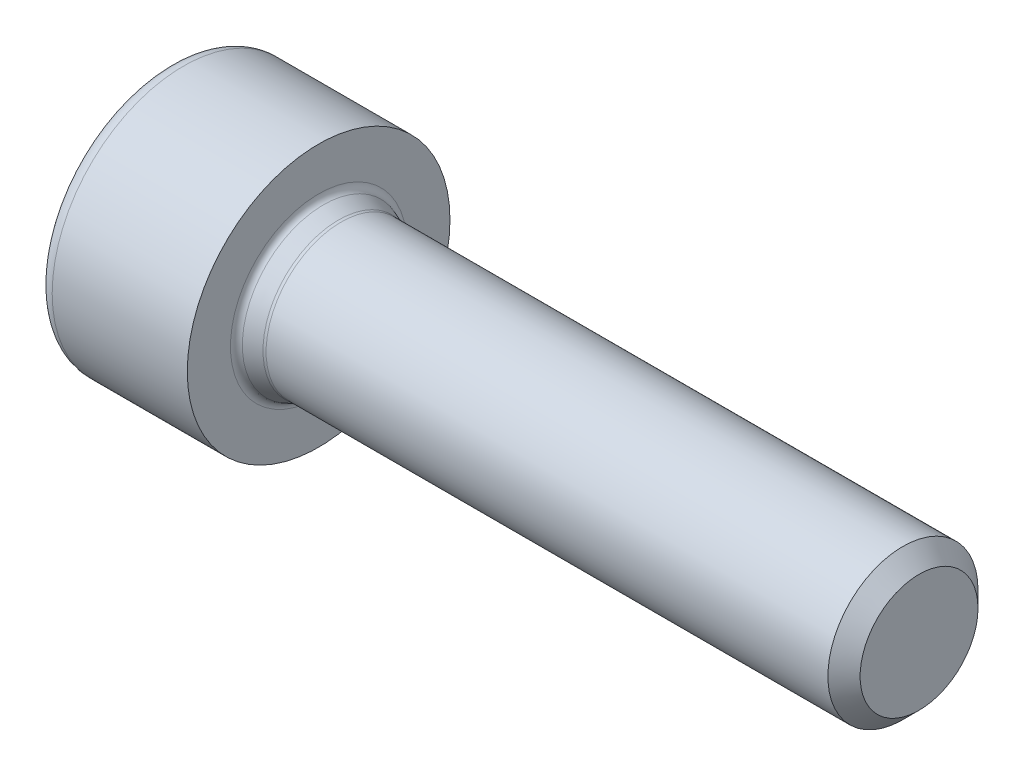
ISO-10303-21;
HEADER;
FILE_DESCRIPTION(('STEP AP214'),'2;1');
FILE_NAME('part.step','',(''),(''),'','','');
FILE_SCHEMA(('AUTOMOTIVE_DESIGN { 1 0 10303 214 1 1 1 1 }'));
ENDSEC;
DATA;
#1=APPLICATION_CONTEXT('core data for automotive mechanical design processes');
#2=APPLICATION_PROTOCOL_DEFINITION('international standard','automotive_design',2000,#1);
#3=PRODUCT_CONTEXT('',#1,'mechanical');
#4=PRODUCT('Part','Part','',(#3));
#5=PRODUCT_RELATED_PRODUCT_CATEGORY('part','',(#4));
#6=PRODUCT_DEFINITION_FORMATION('','',#4);
#7=PRODUCT_DEFINITION_CONTEXT('part definition',#1,'design');
#8=PRODUCT_DEFINITION('design','',#6,#7);
#9=PRODUCT_DEFINITION_SHAPE('','',#8);
#10=(LENGTH_UNIT() NAMED_UNIT(*) SI_UNIT(.MILLI.,.METRE.));
#11=(NAMED_UNIT(*) PLANE_ANGLE_UNIT() SI_UNIT($,.RADIAN.));
#12=(NAMED_UNIT(*) SI_UNIT($,.STERADIAN.) SOLID_ANGLE_UNIT());
#13=UNCERTAINTY_MEASURE_WITH_UNIT(LENGTH_MEASURE(1.E-05),#10,'distance_accuracy_value','');
#14=(GEOMETRIC_REPRESENTATION_CONTEXT(3) GLOBAL_UNCERTAINTY_ASSIGNED_CONTEXT((#13)) GLOBAL_UNIT_ASSIGNED_CONTEXT((#10,
#11,#12)) REPRESENTATION_CONTEXT('',''));
#15=CARTESIAN_POINT('',(0.,0.,0.));
#16=DIRECTION('',(0.,0.,1.));
#17=DIRECTION('',(1.,0.,0.));
#18=AXIS2_PLACEMENT_3D('',#15,#16,#17);
#19=CARTESIAN_POINT('',(-3.78,0.,0.));
#20=DIRECTION('',(-1.,0.,0.));
#21=DIRECTION('',(0.,0.,1.));
#22=AXIS2_PLACEMENT_3D('',#19,#20,#21);
#23=CONICAL_SURFACE('',#22,1.5,0.785398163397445);
#24=CARTESIAN_POINT('',(-4.,0.,0.));
#25=DIRECTION('',(1.,0.,0.));
#26=DIRECTION('',(0.,0.489340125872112,0.872093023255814));
#27=AXIS2_PLACEMENT_3D('',#24,#25,#26);
#28=CIRCLE('',#27,1.72);
#29=CARTESIAN_POINT('',(-4.,0.841665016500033,1.5));
#30=VERTEX_POINT('',#29);
#31=CARTESIAN_POINT('',(-4.,-0.841665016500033,1.5));
#32=VERTEX_POINT('',#31);
#33=EDGE_CURVE('E7',#30,#32,#28,.T.);
#34=ORIENTED_EDGE('',*,*,#33,.F.);
#35=CARTESIAN_POINT('',(-3.99999989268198,0.841664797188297,1.5));
#36=CARTESIAN_POINT('',(-3.99167964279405,0.82466730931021,1.49999556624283));
#37=CARTESIAN_POINT('',(-3.98348579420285,0.807606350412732,1.49995463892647));
#38=CARTESIAN_POINT('',(-3.96770395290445,0.773934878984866,1.49986126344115));
#39=CARTESIAN_POINT('',(-3.96010478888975,0.75732959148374,1.49980927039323));
#40=CARTESIAN_POINT('',(-3.94540605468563,0.724258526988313,1.49974728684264));
#41=CARTESIAN_POINT('',(-3.93829992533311,0.707795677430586,1.49973655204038));
#42=CARTESIAN_POINT('',(-3.92447469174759,0.674711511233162,1.4997624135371));
#43=CARTESIAN_POINT('',(-3.91775551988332,0.658090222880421,1.49979900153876));
#44=CARTESIAN_POINT('',(-3.90459524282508,0.624399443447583,1.49989311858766));
#45=CARTESIAN_POINT('',(-3.89816114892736,0.607327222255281,1.499951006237));
#46=CARTESIAN_POINT('',(-3.88549270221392,0.572588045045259,1.5000063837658));
#47=CARTESIAN_POINT('',(-3.87926834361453,0.554917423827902,1.50000221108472));
#48=CARTESIAN_POINT('',(-3.86734091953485,0.519360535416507,1.5000653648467));
#49=CARTESIAN_POINT('',(-3.8616389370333,0.501473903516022,1.50013283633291));
#50=CARTESIAN_POINT('',(-3.85077525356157,0.465594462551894,1.50028280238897));
#51=CARTESIAN_POINT('',(-3.84561203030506,0.447602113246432,1.50036525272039));
#52=CARTESIAN_POINT('',(-3.83584429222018,0.411547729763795,1.50052646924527));
#53=CARTESIAN_POINT('',(-3.83123750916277,0.39348631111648,1.50060524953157));
#54=CARTESIAN_POINT('',(-3.82259463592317,0.357330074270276,1.50073979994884));
#55=CARTESIAN_POINT('',(-3.81855560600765,0.33923595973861,1.50079569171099));
#56=CARTESIAN_POINT('',(-3.81106188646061,0.303047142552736,1.5008745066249));
#57=CARTESIAN_POINT('',(-3.80760363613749,0.284953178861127,1.50089763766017));
#58=CARTESIAN_POINT('',(-3.80128460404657,0.248794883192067,1.50090724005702));
#59=CARTESIAN_POINT('',(-3.79841971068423,0.230731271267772,1.500893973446));
#60=CARTESIAN_POINT('',(-3.7933006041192,0.194661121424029,1.50083376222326));
#61=CARTESIAN_POINT('',(-3.79104180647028,0.176655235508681,1.50078708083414));
#62=CARTESIAN_POINT('',(-3.7871478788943,0.140725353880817,1.50066899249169));
#63=CARTESIAN_POINT('',(-3.78550778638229,0.122801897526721,1.50059779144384));
#64=CARTESIAN_POINT('',(-3.78286457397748,0.0870591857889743,1.50044579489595));
#65=CARTESIAN_POINT('',(-3.78185622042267,0.0692403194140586,1.5003650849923));
#66=CARTESIAN_POINT('',(-3.78048817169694,0.033726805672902,1.50021313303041));
#67=CARTESIAN_POINT('',(-3.78012311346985,0.0160323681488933,1.5001418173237));
#68=CARTESIAN_POINT('',(-3.78005873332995,-0.0192143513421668,1.50003834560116));
#69=CARTESIAN_POINT('',(-3.78035402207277,-0.0367666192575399,1.50000587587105));
#70=CARTESIAN_POINT('',(-3.78161051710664,-0.0718142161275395,1.49999434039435));
#71=CARTESIAN_POINT('',(-3.78257047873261,-0.0893095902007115,1.50001517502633));
#72=CARTESIAN_POINT('',(-3.78511769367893,-0.124357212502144,1.50007393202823));
#73=CARTESIAN_POINT('',(-3.78670859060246,-0.141909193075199,1.50011195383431));
#74=CARTESIAN_POINT('',(-3.79050871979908,-0.177071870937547,1.50019659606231));
#75=CARTESIAN_POINT('',(-3.79272225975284,-0.194682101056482,1.50024327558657));
#76=CARTESIAN_POINT('',(-3.79775220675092,-0.22996061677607,1.50033234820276));
#77=CARTESIAN_POINT('',(-3.80057332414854,-0.247628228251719,1.5003747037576));
#78=CARTESIAN_POINT('',(-3.80680498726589,-0.283018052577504,1.50044670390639));
#79=CARTESIAN_POINT('',(-3.81022046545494,-0.300739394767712,1.50047623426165));
#80=CARTESIAN_POINT('',(-3.81762711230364,-0.336230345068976,1.50051665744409));
#81=CARTESIAN_POINT('',(-3.82162326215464,-0.353998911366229,1.50052737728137));
#82=CARTESIAN_POINT('',(-3.83017778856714,-0.389574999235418,1.50052770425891));
#83=CARTESIAN_POINT('',(-3.83474105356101,-0.407381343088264,1.50051711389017));
#84=CARTESIAN_POINT('',(-3.84441652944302,-0.443020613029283,1.5004761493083));
#85=CARTESIAN_POINT('',(-3.84953342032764,-0.460852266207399,1.50044559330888));
#86=CARTESIAN_POINT('',(-3.86030267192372,-0.496526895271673,1.50036972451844));
#87=CARTESIAN_POINT('',(-3.86595940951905,-0.514368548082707,1.50032428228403));
#88=CARTESIAN_POINT('',(-3.87779615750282,-0.550044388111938,1.50022977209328));
#89=CARTESIAN_POINT('',(-3.88398018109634,-0.567877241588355,1.50018067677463));
#90=CARTESIAN_POINT('',(-3.89685486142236,-0.603515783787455,1.50008877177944));
#91=CARTESIAN_POINT('',(-3.90354907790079,-0.621320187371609,1.50004601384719));
#92=CARTESIAN_POINT('',(-3.91741278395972,-0.656790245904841,1.50000498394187));
#93=CARTESIAN_POINT('',(-3.92458334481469,-0.674455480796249,1.50000681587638));
#94=CARTESIAN_POINT('',(-3.93899822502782,-0.708948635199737,1.49996730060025));
#95=CARTESIAN_POINT('',(-3.94622874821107,-0.725782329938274,1.49992763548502));
#96=CARTESIAN_POINT('',(-3.9609395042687,-0.75899239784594,1.49990225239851));
#97=CARTESIAN_POINT('',(-3.96841325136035,-0.775371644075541,1.49991561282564));
#98=CARTESIAN_POINT('',(-3.9838737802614,-0.808413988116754,1.49995679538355));
#99=CARTESIAN_POINT('',(-3.99186889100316,-0.825073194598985,1.49998498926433));
#100=CARTESIAN_POINT('',(-3.99999962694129,-0.841664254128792,1.5));
#101=B_SPLINE_CURVE_WITH_KNOTS('',3,(#35,#36,#37,#38,#39,#40,#41,#42,#43,#44,#45,#46,#47,#48,
#49,#50,#51,#52,#53,#54,#55,#56,#57,#58,#59,#60,#61,#62,#63,#64,#65,#66,#67,#68,#69,#70,#71,#72,
#73,#74,#75,#76,#77,#78,#79,#80,#81,#82,#83,#84,#85,#86,#87,#88,#89,#90,#91,#92,#93,#94,#95,#96,
#97,#98,#99,#100),.UNSPECIFIED.,.F.,.F.,(4,2,2,2,2,2,2,2,2,2,2,2,2,2,2,2,2,2,2,2,2,2,2,2,2,2,2,
2,2,2,2,2,4),(0.,0.0567755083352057,0.111556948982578,0.165345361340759,0.219124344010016,
0.273853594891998,0.330051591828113,0.386363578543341,0.442511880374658,0.498422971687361,
0.55403296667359,0.609288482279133,0.664147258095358,0.718578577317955,0.772563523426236,
0.826095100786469,0.879178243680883,0.931829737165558,0.984382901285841,1.03724408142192,
1.09048037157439,1.14414528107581,1.19827886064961,1.25290771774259,1.30804522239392,
1.36369188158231,1.41983586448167,1.47645366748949,1.5335109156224,1.59070113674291,
1.64565974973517,1.69966738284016,1.75509796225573),.UNSPECIFIED.);
#102=EDGE_CURVE('E11',#30,#32,#101,.T.);
#103=ORIENTED_EDGE('',*,*,#102,.T.);
#104=EDGE_LOOP('',(#34,#103));
#105=FACE_BOUND('',#104,.T.);
#106=ADVANCED_FACE('F27',(#105),#23,.F.);
#107=CARTESIAN_POINT('',(-4.,0.,-1.72));
#108=DIRECTION('',(1.,0.,0.));
#109=DIRECTION('',(0.,0.,-1.));
#110=AXIS2_PLACEMENT_3D('',#107,#108,#109);
#111=PLANE('',#110);
#112=CARTESIAN_POINT('',(-4.,0.,0.));
#113=DIRECTION('',(1.,0.,0.));
#114=DIRECTION('',(0.,0.,-1.));
#115=AXIS2_PLACEMENT_3D('',#112,#113,#114);
#116=CIRCLE('',#115,3.10000002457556);
#117=CARTESIAN_POINT('',(-4.,0.,-3.10000002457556));
#118=VERTEX_POINT('',#117);
#119=EDGE_CURVE('E38',#118,#118,#116,.T.);
#120=ORIENTED_EDGE('',*,*,#119,.F.);
#121=EDGE_LOOP('',(#120));
#122=FACE_BOUND('',#121,.T.);
#123=ORIENTED_EDGE('',*,*,#33,.T.);
#124=DIRECTION('',(0.,-1.,0.));
#125=VECTOR('',#124,1.);
#126=CARTESIAN_POINT('',(-4.,-0.841665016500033,1.5));
#127=LINE('',#126,#125);
#128=CARTESIAN_POINT('',(-4.,-0.86602540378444,1.5));
#129=VERTEX_POINT('',#128);
#130=EDGE_CURVE('E45',#32,#129,#127,.T.);
#131=ORIENTED_EDGE('',*,*,#130,.T.);
#132=DIRECTION('',(0.,-0.500000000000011,-0.866025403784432));
#133=VECTOR('',#132,1.);
#134=CARTESIAN_POINT('',(-4.,-0.866025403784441,1.5));
#135=LINE('',#134,#133);
#136=CARTESIAN_POINT('',(-4.,-0.878205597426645,1.47890328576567));
#137=VERTEX_POINT('',#136);
#138=EDGE_CURVE('E52',#129,#137,#135,.T.);
#139=ORIENTED_EDGE('',*,*,#138,.T.);
#140=CARTESIAN_POINT('',(-4.,0.,0.));
#141=DIRECTION('',(1.,0.,0.));
#142=DIRECTION('',(0.,-0.510584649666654,0.85982749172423));
#143=AXIS2_PLACEMENT_3D('',#140,#141,#142);
#144=CIRCLE('',#143,1.72);
#145=CARTESIAN_POINT('',(-4.,-1.71987061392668,0.0210967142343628));
#146=VERTEX_POINT('',#145);
#147=EDGE_CURVE('E59',#137,#146,#144,.T.);
#148=ORIENTED_EDGE('',*,*,#147,.T.);
#149=DIRECTION('',(0.,-0.500000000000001,-0.866025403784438));
#150=VECTOR('',#149,1.);
#151=CARTESIAN_POINT('',(-4.,-1.71987061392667,0.0210967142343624));
#152=LINE('',#151,#150);
#153=CARTESIAN_POINT('',(-4.,-1.7320508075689,0.));
#154=VERTEX_POINT('',#153);
#155=EDGE_CURVE('E66',#146,#154,#152,.T.);
#156=ORIENTED_EDGE('',*,*,#155,.T.);
#157=DIRECTION('',(0.,0.500000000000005,-0.866025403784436));
#158=VECTOR('',#157,1.);
#159=CARTESIAN_POINT('',(-4.,-1.7320508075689,0.));
#160=LINE('',#159,#158);
#161=CARTESIAN_POINT('',(-4.,-1.71987061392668,-0.0210967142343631));
#162=VERTEX_POINT('',#161);
#163=EDGE_CURVE('E73',#154,#162,#160,.T.);
#164=ORIENTED_EDGE('',*,*,#163,.T.);
#165=CARTESIAN_POINT('',(-4.,0.,0.));
#166=DIRECTION('',(1.,0.,0.));
#167=DIRECTION('',(0.,-0.999924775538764,-0.0122655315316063));
#168=AXIS2_PLACEMENT_3D('',#165,#166,#167);
#169=CIRCLE('',#168,1.72);
#170=CARTESIAN_POINT('',(-4.,-0.878205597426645,-1.47890328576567));
#171=VERTEX_POINT('',#170);
#172=EDGE_CURVE('E80',#162,#171,#169,.T.);
#173=ORIENTED_EDGE('',*,*,#172,.T.);
#174=DIRECTION('',(0.,0.500000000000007,-0.866025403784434));
#175=VECTOR('',#174,1.);
#176=CARTESIAN_POINT('',(-4.,-0.878205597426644,-1.47890328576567));
#177=LINE('',#176,#175);
#178=CARTESIAN_POINT('',(-4.,-0.86602540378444,-1.5));
#179=VERTEX_POINT('',#178);
#180=EDGE_CURVE('E87',#171,#179,#177,.T.);
#181=ORIENTED_EDGE('',*,*,#180,.T.);
#182=DIRECTION('',(0.,1.,0.));
#183=VECTOR('',#182,1.);
#184=CARTESIAN_POINT('',(-4.,-0.86602540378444,-1.5));
#185=LINE('',#184,#183);
#186=CARTESIAN_POINT('',(-4.,-0.841665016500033,-1.5));
#187=VERTEX_POINT('',#186);
#188=EDGE_CURVE('E94',#179,#187,#185,.T.);
#189=ORIENTED_EDGE('',*,*,#188,.T.);
#190=CARTESIAN_POINT('',(-4.,0.,0.));
#191=DIRECTION('',(1.,0.,0.));
#192=DIRECTION('',(0.,-0.489340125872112,-0.872093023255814));
#193=AXIS2_PLACEMENT_3D('',#190,#191,#192);
#194=CIRCLE('',#193,1.72);
#195=CARTESIAN_POINT('',(-4.,0.841665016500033,-1.5));
#196=VERTEX_POINT('',#195);
#197=EDGE_CURVE('E101',#187,#196,#194,.T.);
#198=ORIENTED_EDGE('',*,*,#197,.T.);
#199=DIRECTION('',(0.,1.,0.));
#200=VECTOR('',#199,1.);
#201=CARTESIAN_POINT('',(-4.,0.841665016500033,-1.5));
#202=LINE('',#201,#200);
#203=CARTESIAN_POINT('',(-4.,0.86602540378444,-1.5));
#204=VERTEX_POINT('',#203);
#205=EDGE_CURVE('E108',#196,#204,#202,.T.);
#206=ORIENTED_EDGE('',*,*,#205,.T.);
#207=DIRECTION('',(0.,0.500000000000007,0.866025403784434));
#208=VECTOR('',#207,1.);
#209=CARTESIAN_POINT('',(-4.,0.866025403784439,-1.5));
#210=LINE('',#209,#208);
#211=CARTESIAN_POINT('',(-4.,0.878205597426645,-1.47890328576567));
#212=VERTEX_POINT('',#211);
#213=EDGE_CURVE('E115',#204,#212,#210,.T.);
#214=ORIENTED_EDGE('',*,*,#213,.T.);
#215=CARTESIAN_POINT('',(-4.,0.,0.));
#216=DIRECTION('',(1.,0.,0.));
#217=DIRECTION('',(0.,0.510584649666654,-0.859827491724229));
#218=AXIS2_PLACEMENT_3D('',#215,#216,#217);
#219=CIRCLE('',#218,1.72);
#220=CARTESIAN_POINT('',(-4.,1.71987061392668,-0.0210967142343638));
#221=VERTEX_POINT('',#220);
#222=EDGE_CURVE('E122',#212,#221,#219,.T.);
#223=ORIENTED_EDGE('',*,*,#222,.T.);
#224=DIRECTION('',(0.,0.500000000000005,0.866025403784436));
#225=VECTOR('',#224,1.);
#226=CARTESIAN_POINT('',(-4.,1.71987061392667,-0.021096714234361));
#227=LINE('',#226,#225);
#228=CARTESIAN_POINT('',(-4.,1.7320508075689,0.));
#229=VERTEX_POINT('',#228);
#230=EDGE_CURVE('E129',#221,#229,#227,.T.);
#231=ORIENTED_EDGE('',*,*,#230,.T.);
#232=DIRECTION('',(0.,-0.500000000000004,0.866025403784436));
#233=VECTOR('',#232,1.);
#234=CARTESIAN_POINT('',(-4.,1.7320508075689,0.));
#235=LINE('',#234,#233);
#236=CARTESIAN_POINT('',(-4.,1.71987061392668,0.0210967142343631));
#237=VERTEX_POINT('',#236);
#238=EDGE_CURVE('E136',#229,#237,#235,.T.);
#239=ORIENTED_EDGE('',*,*,#238,.T.);
#240=CARTESIAN_POINT('',(-4.,0.,0.));
#241=DIRECTION('',(1.,0.,0.));
#242=DIRECTION('',(0.,0.999924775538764,0.0122655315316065));
#243=AXIS2_PLACEMENT_3D('',#240,#241,#242);
#244=CIRCLE('',#243,1.72);
#245=CARTESIAN_POINT('',(-4.,0.878205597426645,1.47890328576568));
#246=VERTEX_POINT('',#245);
#247=EDGE_CURVE('E143',#237,#246,#244,.T.);
#248=ORIENTED_EDGE('',*,*,#247,.T.);
#249=DIRECTION('',(0.,-0.500000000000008,0.866025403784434));
#250=VECTOR('',#249,1.);
#251=CARTESIAN_POINT('',(-4.,0.878205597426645,1.47890328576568));
#252=LINE('',#251,#250);
#253=CARTESIAN_POINT('',(-4.,0.86602540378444,1.5));
#254=VERTEX_POINT('',#253);
#255=EDGE_CURVE('E150',#246,#254,#252,.T.);
#256=ORIENTED_EDGE('',*,*,#255,.T.);
#257=DIRECTION('',(0.,-1.,0.));
#258=VECTOR('',#257,1.);
#259=CARTESIAN_POINT('',(-4.,0.86602540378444,1.5));
#260=LINE('',#259,#258);
#261=EDGE_CURVE('E157',#254,#30,#260,.T.);
#262=ORIENTED_EDGE('',*,*,#261,.T.);
#263=EDGE_LOOP('',(#123,#131,#139,#148,#156,#164,#173,#181,#189,#198,#206,#214,#223,#231,#239,
#248,#256,#262));
#264=FACE_BOUND('',#263,.T.);
#265=ADVANCED_FACE('F161',(#122,#264),#111,.F.);
#266=CARTESIAN_POINT('',(-5.4,0.86602540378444,1.5));
#267=DIRECTION('',(0.,0.,1.));
#268=DIRECTION('',(1.,0.,0.));
#269=AXIS2_PLACEMENT_3D('',#266,#267,#268);
#270=PLANE('',#269);
#271=DIRECTION('',(0.,-1.,0.));
#272=VECTOR('',#271,1.);
#273=CARTESIAN_POINT('',(-1.4,0.,1.5));
#274=LINE('',#273,#272);
#275=CARTESIAN_POINT('',(-1.4,0.,1.5));
#276=VERTEX_POINT('',#275);
#277=CARTESIAN_POINT('',(-1.4,-0.86602540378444,1.5));
#278=VERTEX_POINT('',#277);
#279=EDGE_CURVE('E170',#276,#278,#274,.T.);
#280=ORIENTED_EDGE('',*,*,#279,.T.);
#281=DIRECTION('',(1.,0.,0.));
#282=VECTOR('',#281,1.);
#283=CARTESIAN_POINT('',(-4.,-0.86602540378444,1.5));
#284=LINE('',#283,#282);
#285=EDGE_CURVE('E177',#129,#278,#284,.T.);
#286=ORIENTED_EDGE('',*,*,#285,.F.);
#287=ORIENTED_EDGE('',*,*,#130,.F.);
#288=ORIENTED_EDGE('',*,*,#102,.F.);
#289=ORIENTED_EDGE('',*,*,#261,.F.);
#290=DIRECTION('',(1.,0.,0.));
#291=VECTOR('',#290,1.);
#292=CARTESIAN_POINT('',(-4.,0.86602540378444,1.5));
#293=LINE('',#292,#291);
#294=CARTESIAN_POINT('',(-1.4,0.86602540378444,1.5));
#295=VERTEX_POINT('',#294);
#296=EDGE_CURVE('E196',#254,#295,#293,.T.);
#297=ORIENTED_EDGE('',*,*,#296,.T.);
#298=DIRECTION('',(0.,-1.,0.));
#299=VECTOR('',#298,1.);
#300=CARTESIAN_POINT('',(-1.4,0.86602540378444,1.5));
#301=LINE('',#300,#299);
#302=EDGE_CURVE('E203',#295,#276,#301,.T.);
#303=ORIENTED_EDGE('',*,*,#302,.T.);
#304=EDGE_LOOP('',(#280,#286,#287,#288,#289,#297,#303));
#305=FACE_BOUND('',#304,.T.);
#306=ADVANCED_FACE('F208',(#305),#270,.F.);
#307=CARTESIAN_POINT('',(-3.59999999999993,0.,0.));
#308=DIRECTION('',(1.,0.,0.));
#309=DIRECTION('',(0.,0.,-1.));
#310=AXIS2_PLACEMENT_3D('',#307,#308,#309);
#311=TOROIDAL_SURFACE('',#310,3.09999999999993,0.400000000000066);
#312=ORIENTED_EDGE('',*,*,#119,.T.);
#313=EDGE_LOOP('',(#312));
#314=FACE_BOUND('',#313,.T.);
#315=CARTESIAN_POINT('',(-3.6,0.,0.));
#316=DIRECTION('',(1.,0.,0.));
#317=DIRECTION('',(0.,0.,-1.));
#318=AXIS2_PLACEMENT_3D('',#315,#316,#317);
#319=CIRCLE('',#318,3.5);
#320=CARTESIAN_POINT('',(-3.6,0.,-3.5));
#321=VERTEX_POINT('',#320);
#322=EDGE_CURVE('E217',#321,#321,#319,.T.);
#323=ORIENTED_EDGE('',*,*,#322,.F.);
#324=EDGE_LOOP('',(#323));
#325=FACE_BOUND('',#324,.T.);
#326=ADVANCED_FACE('F221',(#314,#325),#311,.T.);
#327=CARTESIAN_POINT('',(-5.4,-0.86602540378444,1.5));
#328=DIRECTION('',(0.,-0.866025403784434,0.500000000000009));
#329=DIRECTION('',(0.,-0.500000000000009,-0.866025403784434));
#330=AXIS2_PLACEMENT_3D('',#327,#328,#329);
#331=PLANE('',#330);
#332=DIRECTION('',(0.,-0.500000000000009,-0.866025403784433));
#333=VECTOR('',#332,1.);
#334=CARTESIAN_POINT('',(-1.4,-1.29903810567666,0.750000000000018));
#335=LINE('',#334,#333);
#336=CARTESIAN_POINT('',(-1.4,-1.29903810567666,0.750000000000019));
#337=VERTEX_POINT('',#336);
#338=CARTESIAN_POINT('',(-1.4,-1.7320508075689,0.));
#339=VERTEX_POINT('',#338);
#340=EDGE_CURVE('E230',#337,#339,#335,.T.);
#341=ORIENTED_EDGE('',*,*,#340,.T.);
#342=DIRECTION('',(1.,0.,0.));
#343=VECTOR('',#342,1.);
#344=CARTESIAN_POINT('',(-4.,-1.7320508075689,0.));
#345=LINE('',#344,#343);
#346=EDGE_CURVE('E237',#154,#339,#345,.T.);
#347=ORIENTED_EDGE('',*,*,#346,.F.);
#348=ORIENTED_EDGE('',*,*,#155,.F.);
#349=CARTESIAN_POINT('',(-3.9999999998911,-0.878205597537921,1.47890328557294));
#350=CARTESIAN_POINT('',(-3.9878022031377,-0.890672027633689,1.45731124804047));
#351=CARTESIAN_POINT('',(-3.97588207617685,-0.903147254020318,1.43556306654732));
#352=CARTESIAN_POINT('',(-3.95321065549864,-0.927659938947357,1.39267517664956));
#353=CARTESIAN_POINT('',(-3.94243130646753,-0.939693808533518,1.37154821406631));
#354=CARTESIAN_POINT('',(-3.92201194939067,-0.963438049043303,1.32982831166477));
#355=CARTESIAN_POINT('',(-3.9123440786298,-0.9751430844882,1.30924604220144));
#356=CARTESIAN_POINT('',(-3.89412158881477,-0.998330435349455,1.26853248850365));
#357=CARTESIAN_POINT('',(-3.8855402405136,-1.00980672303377,1.24840977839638));
#358=CARTESIAN_POINT('',(-3.86946239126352,-1.03262384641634,1.20852318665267));
#359=CARTESIAN_POINT('',(-3.86194163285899,-1.04395894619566,1.18876584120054));
#360=CARTESIAN_POINT('',(-3.84795558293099,-1.06656741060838,1.14950942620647));
#361=CARTESIAN_POINT('',(-3.84146987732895,-1.07783612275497,1.13001497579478));
#362=CARTESIAN_POINT('',(-3.82952268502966,-1.10037142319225,1.09117541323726));
#363=CARTESIAN_POINT('',(-3.82404594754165,-1.11163492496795,1.07183321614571));
#364=CARTESIAN_POINT('',(-3.81408561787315,-1.13420675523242,1.03318201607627));
#365=CARTESIAN_POINT('',(-3.80959296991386,-1.14551360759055,1.01387448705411));
#366=CARTESIAN_POINT('',(-3.80156357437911,-1.1682003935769,0.975166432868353));
#367=CARTESIAN_POINT('',(-3.79802461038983,-1.17958009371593,0.955766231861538));
#368=CARTESIAN_POINT('',(-3.79188431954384,-1.20244329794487,0.916748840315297));
#369=CARTESIAN_POINT('',(-3.78928772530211,-1.21392703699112,0.897131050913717));
#370=CARTESIAN_POINT('',(-3.78494041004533,-1.23695455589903,0.85750588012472));
#371=CARTESIAN_POINT('',(-3.78320056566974,-1.24849731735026,0.837496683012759));
#372=CARTESIAN_POINT('',(-3.78088731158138,-1.27195485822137,0.797087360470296));
#373=CARTESIAN_POINT('',(-3.78033798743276,-1.2838724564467,0.776687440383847));
#374=CARTESIAN_POINT('',(-3.78037360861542,-1.3079382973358,0.735525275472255));
#375=CARTESIAN_POINT('',(-3.78097950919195,-1.320086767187,0.714763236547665));
#376=CARTESIAN_POINT('',(-3.78330588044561,-1.34448805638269,0.67295857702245));
#377=CARTESIAN_POINT('',(-3.78504237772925,-1.35673983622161,0.651916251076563));
#378=CARTESIAN_POINT('',(-3.78960824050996,-1.38124371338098,0.609655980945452));
#379=CARTESIAN_POINT('',(-3.79244878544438,-1.3934944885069,0.588438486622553));
#380=CARTESIAN_POINT('',(-3.79920187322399,-1.41792015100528,0.545957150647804));
#381=CARTESIAN_POINT('',(-3.80312078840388,-1.43009413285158,0.524693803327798));
#382=CARTESIAN_POINT('',(-3.81200810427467,-1.45431682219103,0.48227491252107));
#383=CARTESIAN_POINT('',(-3.81697797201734,-1.46636532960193,0.461119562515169));
#384=CARTESIAN_POINT('',(-3.82795075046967,-1.49032177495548,0.419100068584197));
#385=CARTESIAN_POINT('',(-3.83394997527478,-1.50223005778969,0.398235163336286));
#386=CARTESIAN_POINT('',(-3.84692210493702,-1.52586543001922,0.357066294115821));
#387=CARTESIAN_POINT('',(-3.85388245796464,-1.53759297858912,0.336758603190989));
#388=CARTESIAN_POINT('',(-3.86840895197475,-1.5606079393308,0.29667512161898));
#389=CARTESIAN_POINT('',(-3.87596102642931,-1.57189948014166,0.276896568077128));
#390=CARTESIAN_POINT('',(-3.89182634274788,-1.59434287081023,0.237699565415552));
#391=CARTESIAN_POINT('',(-3.90013597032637,-1.60549512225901,0.218279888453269));
#392=CARTESIAN_POINT('',(-3.91759449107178,-1.62785983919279,0.179493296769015));
#393=CARTESIAN_POINT('',(-3.92675238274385,-1.63907138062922,0.160129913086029));
#394=CARTESIAN_POINT('',(-3.94600835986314,-1.66172834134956,0.121126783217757));
#395=CARTESIAN_POINT('',(-3.95612596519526,-1.67317115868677,0.101495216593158));
#396=CARTESIAN_POINT('',(-3.97739883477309,-1.69641004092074,0.0615774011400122));
#397=CARTESIAN_POINT('',(-3.98858024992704,-1.70819911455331,0.0413009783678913));
#398=CARTESIAN_POINT('',(-3.99999999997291,-1.71987061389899,0.0210967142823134));
#399=B_SPLINE_CURVE_WITH_KNOTS('',3,(#349,#350,#351,#352,#353,#354,#355,#356,#357,#358,#359,
#360,#361,#362,#363,#364,#365,#366,#367,#368,#369,#370,#371,#372,#373,#374,#375,#376,#377,#378,
#379,#380,#381,#382,#383,#384,#385,#386,#387,#388,#389,#390,#391,#392,#393,#394,#395,#396,#397,
#398),.UNSPECIFIED.,.F.,.F.,(4,2,2,2,2,2,2,2,2,2,2,2,2,2,2,2,2,2,2,2,2,2,2,2,4),(0.,
0.0832721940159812,0.163051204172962,0.239764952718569,0.313861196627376,0.385806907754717,
0.456086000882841,0.525195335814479,0.593639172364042,0.661922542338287,0.730544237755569,
0.800015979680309,0.870880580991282,0.94304287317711,1.01625104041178,1.09022067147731,
1.16463715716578,1.2391582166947,1.31341779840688,1.38678601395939,1.45875653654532,
1.53040005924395,1.60291721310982,1.6775295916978,1.75546795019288),.UNSPECIFIED.);
#400=EDGE_CURVE('E240',#137,#146,#399,.T.);
#401=ORIENTED_EDGE('',*,*,#400,.F.);
#402=ORIENTED_EDGE('',*,*,#138,.F.);
#403=ORIENTED_EDGE('',*,*,#285,.T.);
#404=DIRECTION('',(0.,-0.500000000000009,-0.866025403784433));
#405=VECTOR('',#404,1.);
#406=CARTESIAN_POINT('',(-1.4,-0.86602540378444,1.5));
#407=LINE('',#406,#405);
#408=EDGE_CURVE('E258',#278,#337,#407,.T.);
#409=ORIENTED_EDGE('',*,*,#408,.T.);
#410=EDGE_LOOP('',(#341,#347,#348,#401,#402,#403,#409));
#411=FACE_BOUND('',#410,.T.);
#412=ADVANCED_FACE('F263',(#411),#331,.F.);
#413=ORIENTED_EDGE('',*,*,#147,.F.);
#414=ORIENTED_EDGE('',*,*,#400,.T.);
#415=EDGE_LOOP('',(#413,#414));
#416=FACE_BOUND('',#415,.T.);
#417=ADVANCED_FACE('F282',(#416),#23,.F.);
#418=CARTESIAN_POINT('',(-5.4,-1.7320508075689,0.));
#419=DIRECTION('',(0.,-0.866025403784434,-0.500000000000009));
#420=DIRECTION('',(0.,0.500000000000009,-0.866025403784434));
#421=AXIS2_PLACEMENT_3D('',#418,#419,#420);
#422=PLANE('',#421);
#423=DIRECTION('',(0.,0.500000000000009,-0.866025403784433));
#424=VECTOR('',#423,1.);
#425=CARTESIAN_POINT('',(-1.4,-1.29903810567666,-0.750000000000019));
#426=LINE('',#425,#424);
#427=CARTESIAN_POINT('',(-1.4,-1.29903810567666,-0.750000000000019));
#428=VERTEX_POINT('',#427);
#429=CARTESIAN_POINT('',(-1.4,-0.86602540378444,-1.5));
#430=VERTEX_POINT('',#429);
#431=EDGE_CURVE('E291',#428,#430,#426,.T.);
#432=ORIENTED_EDGE('',*,*,#431,.T.);
#433=DIRECTION('',(1.,0.,0.));
#434=VECTOR('',#433,1.);
#435=CARTESIAN_POINT('',(-4.,-0.86602540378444,-1.5));
#436=LINE('',#435,#434);
#437=EDGE_CURVE('E298',#179,#430,#436,.T.);
#438=ORIENTED_EDGE('',*,*,#437,.F.);
#439=ORIENTED_EDGE('',*,*,#180,.F.);
#440=CARTESIAN_POINT('',(-3.9999999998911,-1.7198706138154,-0.0210967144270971));
#441=CARTESIAN_POINT('',(-3.9878022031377,-1.7074045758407,-0.0426889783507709));
#442=CARTESIAN_POINT('',(-3.97588207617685,-1.69480771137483,-0.0643669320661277));
#443=CARTESIAN_POINT('',(-3.95321065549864,-1.66992205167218,-0.107039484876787));
#444=CARTESIAN_POINT('',(-3.94243130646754,-1.65764250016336,-0.128024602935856));
#445=CARTESIAN_POINT('',(-3.92201194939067,-1.6333841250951,-0.16944766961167));
#446=CARTESIAN_POINT('',(-3.9123440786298,-1.62141187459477,-0.189875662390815));
#447=CARTESIAN_POINT('',(-3.89412158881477,-1.59774657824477,-0.23031327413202));
#448=CARTESIAN_POINT('',(-3.8855402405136,-1.58605794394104,-0.250313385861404));
#449=CARTESIAN_POINT('',(-3.86946239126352,-1.5629237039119,-0.290016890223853));
#450=CARTESIAN_POINT('',(-3.86194163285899,-1.55148089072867,-0.30971204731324));
#451=CARTESIAN_POINT('',(-3.84795558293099,-1.52878807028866,-0.348919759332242));
#452=CARTESIAN_POINT('',(-3.84146987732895,-1.5175397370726,-0.368425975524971));
#453=CARTESIAN_POINT('',(-3.82952268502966,-1.49517133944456,-0.407361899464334));
#454=CARTESIAN_POINT('',(-3.82404594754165,-1.48405225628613,-0.426787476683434));
#455=CARTESIAN_POINT('',(-3.81408561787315,-1.46186525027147,-0.465660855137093));
#456=CARTESIAN_POINT('',(-3.80959296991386,-1.45079786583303,-0.485106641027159));
#457=CARTESIAN_POINT('',(-3.80156357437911,-1.42861910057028,-0.524108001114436));
#458=CARTESIAN_POINT('',(-3.79802461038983,-1.41750788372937,-0.543663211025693));
#459=CARTESIAN_POINT('',(-3.79188431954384,-1.39514943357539,-0.582972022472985));
#460=CARTESIAN_POINT('',(-3.78928772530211,-1.38390179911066,-0.602726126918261));
#461=CARTESIAN_POINT('',(-3.78494041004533,-1.36109915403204,-0.642481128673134));
#462=CARTESIAN_POINT('',(-3.78320056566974,-1.34954206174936,-0.662482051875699));
#463=CARTESIAN_POINT('',(-3.78088731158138,-1.32627533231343,-0.703001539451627));
#464=CARTESIAN_POINT('',(-3.78033798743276,-1.31456728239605,-0.723522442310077));
#465=CARTESIAN_POINT('',(-3.78037360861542,-1.2909527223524,-0.76494515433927));
#466=CARTESIAN_POINT('',(-3.78097950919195,-1.27904650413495,-0.785847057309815));
#467=CARTESIAN_POINT('',(-3.78330588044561,-1.2550432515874,-0.82788152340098));
#468=CARTESIAN_POINT('',(-3.78504237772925,-1.242945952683,-0.849013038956));
#469=CARTESIAN_POINT('',(-3.78960824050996,-1.21859942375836,-0.891364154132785));
#470=CARTESIAN_POINT('',(-3.79244878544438,-1.20634992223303,-0.912582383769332));
#471=CARTESIAN_POINT('',(-3.79920187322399,-1.18177283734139,-0.954976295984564));
#472=CARTESIAN_POINT('',(-3.80312078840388,-1.16944522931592,-0.976150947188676));
#473=CARTESIAN_POINT('',(-3.81200810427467,-1.14482073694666,-1.01833785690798));
#474=CARTESIAN_POINT('',(-3.81697797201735,-1.13252392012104,-1.03934984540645));
#475=CARTESIAN_POINT('',(-3.82795075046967,-1.10811219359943,-1.08110648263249));
#476=CARTESIAN_POINT('',(-3.83394997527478,-1.09599679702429,-1.10185181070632));
#477=CARTESIAN_POINT('',(-3.84692210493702,-1.07216119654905,-1.14290507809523));
#478=CARTESIAN_POINT('',(-3.85388245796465,-1.0604379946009,-1.1632152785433));
#479=CARTESIAN_POINT('',(-3.86840895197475,-1.03723216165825,-1.20318855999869));
#480=CARTESIAN_POINT('',(-3.87596102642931,-1.02574920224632,-1.22285659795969));
#481=CARTESIAN_POINT('',(-3.89182634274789,-1.00302529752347,-1.26189164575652));
#482=CARTESIAN_POINT('',(-3.90013597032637,-0.991783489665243,-1.2812596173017));
#483=CARTESIAN_POINT('',(-3.91759449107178,-0.969375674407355,-1.32002132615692));
#484=CARTESIAN_POINT('',(-3.92675238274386,-0.958212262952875,-1.33941249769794));
#485=CARTESIAN_POINT('',(-3.94600835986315,-0.935763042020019,-1.37853556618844));
#486=CARTESIAN_POINT('',(-3.95612596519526,-0.924483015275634,-1.39826112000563));
#487=CARTESIAN_POINT('',(-3.97739883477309,-0.901532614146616,-1.43834549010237));
#488=CARTESIAN_POINT('',(-3.98858024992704,-0.889867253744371,-1.45869333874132));
#489=CARTESIAN_POINT('',(-3.99999999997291,-0.878205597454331,-1.47890328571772));
#490=B_SPLINE_CURVE_WITH_KNOTS('',3,(#440,#441,#442,#443,#444,#445,#446,#447,#448,#449,#450,
#451,#452,#453,#454,#455,#456,#457,#458,#459,#460,#461,#462,#463,#464,#465,#466,#467,#468,#469,
#470,#471,#472,#473,#474,#475,#476,#477,#478,#479,#480,#481,#482,#483,#484,#485,#486,#487,#488,
#489),.UNSPECIFIED.,.F.,.F.,(4,2,2,2,2,2,2,2,2,2,2,2,2,2,2,2,2,2,2,2,2,2,2,2,4),(0.,
0.083272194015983,0.163051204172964,0.239764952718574,0.31386119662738,0.385806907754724,
0.456086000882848,0.525195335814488,0.593639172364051,0.661922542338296,0.730544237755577,
0.800015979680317,0.870880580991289,0.943042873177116,1.01625104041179,1.09022067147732,
1.16463715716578,1.2391582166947,1.31341779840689,1.3867860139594,1.45875653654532,
1.53040005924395,1.60291721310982,1.6775295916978,1.75546795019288),.UNSPECIFIED.);
#491=EDGE_CURVE('E301',#162,#171,#490,.T.);
#492=ORIENTED_EDGE('',*,*,#491,.F.);
#493=ORIENTED_EDGE('',*,*,#163,.F.);
#494=ORIENTED_EDGE('',*,*,#346,.T.);
#495=DIRECTION('',(0.,0.500000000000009,-0.866025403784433));
#496=VECTOR('',#495,1.);
#497=CARTESIAN_POINT('',(-1.4,-1.7320508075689,0.));
#498=LINE('',#497,#496);
#499=EDGE_CURVE('E319',#339,#428,#498,.T.);
#500=ORIENTED_EDGE('',*,*,#499,.T.);
#501=EDGE_LOOP('',(#432,#438,#439,#492,#493,#494,#500));
#502=FACE_BOUND('',#501,.T.);
#503=ADVANCED_FACE('F324',(#502),#422,.F.);
#504=ORIENTED_EDGE('',*,*,#172,.F.);
#505=ORIENTED_EDGE('',*,*,#491,.T.);
#506=EDGE_LOOP('',(#504,#505));
#507=FACE_BOUND('',#506,.T.);
#508=ADVANCED_FACE('F343',(#507),#23,.F.);
#509=CARTESIAN_POINT('',(-5.4,-0.86602540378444,-1.5));
#510=DIRECTION('',(0.,0.,-1.));
#511=DIRECTION('',(-1.,0.,0.));
#512=AXIS2_PLACEMENT_3D('',#509,#510,#511);
#513=PLANE('',#512);
#514=DIRECTION('',(0.,1.,0.));
#515=VECTOR('',#514,1.);
#516=CARTESIAN_POINT('',(-1.4,0.,-1.5));
#517=LINE('',#516,#515);
#518=CARTESIAN_POINT('',(-1.4,0.,-1.5));
#519=VERTEX_POINT('',#518);
#520=CARTESIAN_POINT('',(-1.4,0.86602540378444,-1.5));
#521=VERTEX_POINT('',#520);
#522=EDGE_CURVE('E352',#519,#521,#517,.T.);
#523=ORIENTED_EDGE('',*,*,#522,.T.);
#524=DIRECTION('',(1.,0.,0.));
#525=VECTOR('',#524,1.);
#526=CARTESIAN_POINT('',(-4.,0.86602540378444,-1.5));
#527=LINE('',#526,#525);
#528=EDGE_CURVE('E359',#204,#521,#527,.T.);
#529=ORIENTED_EDGE('',*,*,#528,.F.);
#530=ORIENTED_EDGE('',*,*,#205,.F.);
#531=CARTESIAN_POINT('',(-3.99999989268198,-0.841664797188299,-1.5));
#532=CARTESIAN_POINT('',(-3.99167964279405,-0.824667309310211,-1.49999556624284));
#533=CARTESIAN_POINT('',(-3.98348579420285,-0.807606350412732,-1.49995463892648));
#534=CARTESIAN_POINT('',(-3.96770395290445,-0.773934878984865,-1.49986126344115));
#535=CARTESIAN_POINT('',(-3.96010478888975,-0.757329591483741,-1.49980927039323));
#536=CARTESIAN_POINT('',(-3.94540605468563,-0.724258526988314,-1.49974728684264));
#537=CARTESIAN_POINT('',(-3.93829992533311,-0.707795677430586,-1.49973655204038));
#538=CARTESIAN_POINT('',(-3.92447469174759,-0.674711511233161,-1.4997624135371));
#539=CARTESIAN_POINT('',(-3.91775551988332,-0.65809022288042,-1.49979900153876));
#540=CARTESIAN_POINT('',(-3.90459524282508,-0.624399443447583,-1.49989311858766));
#541=CARTESIAN_POINT('',(-3.89816114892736,-0.607327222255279,-1.499951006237));
#542=CARTESIAN_POINT('',(-3.88549270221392,-0.572588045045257,-1.5000063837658));
#543=CARTESIAN_POINT('',(-3.87926834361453,-0.5549174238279,-1.50000221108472));
#544=CARTESIAN_POINT('',(-3.86734091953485,-0.519360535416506,-1.5000653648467));
#545=CARTESIAN_POINT('',(-3.8616389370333,-0.501473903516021,-1.50013283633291));
#546=CARTESIAN_POINT('',(-3.85077525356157,-0.465594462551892,-1.50028280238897));
#547=CARTESIAN_POINT('',(-3.84561203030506,-0.44760211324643,-1.50036525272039));
#548=CARTESIAN_POINT('',(-3.83584429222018,-0.411547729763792,-1.50052646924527));
#549=CARTESIAN_POINT('',(-3.83123750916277,-0.393486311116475,-1.50060524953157));
#550=CARTESIAN_POINT('',(-3.82259463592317,-0.357330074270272,-1.50073979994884));
#551=CARTESIAN_POINT('',(-3.81855560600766,-0.339235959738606,-1.50079569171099));
#552=CARTESIAN_POINT('',(-3.81106188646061,-0.303047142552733,-1.5008745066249));
#553=CARTESIAN_POINT('',(-3.80760363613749,-0.284953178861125,-1.50089763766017));
#554=CARTESIAN_POINT('',(-3.80128460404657,-0.248794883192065,-1.50090724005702));
#555=CARTESIAN_POINT('',(-3.79841971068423,-0.23073127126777,-1.50089397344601));
#556=CARTESIAN_POINT('',(-3.7933006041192,-0.194661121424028,-1.50083376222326));
#557=CARTESIAN_POINT('',(-3.79104180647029,-0.17665523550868,-1.50078708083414));
#558=CARTESIAN_POINT('',(-3.7871478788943,-0.140725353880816,-1.50066899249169));
#559=CARTESIAN_POINT('',(-3.78550778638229,-0.12280189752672,-1.50059779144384));
#560=CARTESIAN_POINT('',(-3.78286457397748,-0.0870591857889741,-1.50044579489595));
#561=CARTESIAN_POINT('',(-3.78185622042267,-0.0692403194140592,-1.5003650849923));
#562=CARTESIAN_POINT('',(-3.78048817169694,-0.0337268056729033,-1.50021313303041));
#563=CARTESIAN_POINT('',(-3.78012311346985,-0.0160323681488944,-1.5001418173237));
#564=CARTESIAN_POINT('',(-3.78005873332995,0.0192143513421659,-1.50003834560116));
#565=CARTESIAN_POINT('',(-3.78035402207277,0.036766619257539,-1.50000587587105));
#566=CARTESIAN_POINT('',(-3.78161051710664,0.0718142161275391,-1.49999434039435));
#567=CARTESIAN_POINT('',(-3.78257047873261,0.0893095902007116,-1.50001517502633));
#568=CARTESIAN_POINT('',(-3.78511769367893,0.124357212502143,-1.50007393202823));
#569=CARTESIAN_POINT('',(-3.78670859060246,0.141909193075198,-1.50011195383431));
#570=CARTESIAN_POINT('',(-3.79050871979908,0.177071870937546,-1.50019659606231));
#571=CARTESIAN_POINT('',(-3.79272225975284,0.194682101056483,-1.50024327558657));
#572=CARTESIAN_POINT('',(-3.79775220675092,0.22996061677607,-1.50033234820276));
#573=CARTESIAN_POINT('',(-3.80057332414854,0.247628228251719,-1.5003747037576));
#574=CARTESIAN_POINT('',(-3.80680498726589,0.283018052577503,-1.50044670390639));
#575=CARTESIAN_POINT('',(-3.81022046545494,0.300739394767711,-1.50047623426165));
#576=CARTESIAN_POINT('',(-3.81762711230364,0.336230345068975,-1.50051665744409));
#577=CARTESIAN_POINT('',(-3.82162326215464,0.353998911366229,-1.50052737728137));
#578=CARTESIAN_POINT('',(-3.83017778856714,0.389574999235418,-1.50052770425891));
#579=CARTESIAN_POINT('',(-3.83474105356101,0.407381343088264,-1.50051711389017));
#580=CARTESIAN_POINT('',(-3.84441652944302,0.443020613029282,-1.5004761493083));
#581=CARTESIAN_POINT('',(-3.84953342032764,0.460852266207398,-1.50044559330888));
#582=CARTESIAN_POINT('',(-3.86030267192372,0.496526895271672,-1.50036972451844));
#583=CARTESIAN_POINT('',(-3.86595940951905,0.514368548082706,-1.50032428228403));
#584=CARTESIAN_POINT('',(-3.87779615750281,0.550044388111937,-1.50022977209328));
#585=CARTESIAN_POINT('',(-3.88398018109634,0.567877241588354,-1.50018067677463));
#586=CARTESIAN_POINT('',(-3.89685486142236,0.603515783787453,-1.50008877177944));
#587=CARTESIAN_POINT('',(-3.90354907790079,0.621320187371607,-1.50004601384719));
#588=CARTESIAN_POINT('',(-3.91741278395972,0.656790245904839,-1.50000498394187));
#589=CARTESIAN_POINT('',(-3.92458334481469,0.674455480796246,-1.50000681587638));
#590=CARTESIAN_POINT('',(-3.93899822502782,0.708948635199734,-1.49996730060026));
#591=CARTESIAN_POINT('',(-3.94622874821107,0.725782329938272,-1.49992763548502));
#592=CARTESIAN_POINT('',(-3.96093950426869,0.758992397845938,-1.49990225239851));
#593=CARTESIAN_POINT('',(-3.96841325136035,0.775371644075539,-1.49991561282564));
#594=CARTESIAN_POINT('',(-3.98387378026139,0.808413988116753,-1.49995679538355));
#595=CARTESIAN_POINT('',(-3.99186889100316,0.825073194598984,-1.49998498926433));
#596=CARTESIAN_POINT('',(-3.99999962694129,0.841664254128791,-1.5));
#597=B_SPLINE_CURVE_WITH_KNOTS('',3,(#531,#532,#533,#534,#535,#536,#537,#538,#539,#540,#541,
#542,#543,#544,#545,#546,#547,#548,#549,#550,#551,#552,#553,#554,#555,#556,#557,#558,#559,#560,
#561,#562,#563,#564,#565,#566,#567,#568,#569,#570,#571,#572,#573,#574,#575,#576,#577,#578,#579,
#580,#581,#582,#583,#584,#585,#586,#587,#588,#589,#590,#591,#592,#593,#594,#595,#596),
.UNSPECIFIED.,.F.,.F.,(4,2,2,2,2,2,2,2,2,2,2,2,2,2,2,2,2,2,2,2,2,2,2,2,2,2,2,2,2,2,2,2,4),(0.,
0.056775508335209,0.111556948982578,0.165345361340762,0.219124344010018,0.273853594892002,
0.330051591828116,0.386363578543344,0.442511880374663,0.498422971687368,0.554032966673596,
0.609288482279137,0.664147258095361,0.718578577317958,0.772563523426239,0.82609510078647,
0.879178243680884,0.931829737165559,0.984382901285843,1.03724408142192,1.0904803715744,
1.14414528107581,1.19827886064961,1.25290771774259,1.30804522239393,1.36369188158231,
1.41983586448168,1.47645366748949,1.5335109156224,1.59070113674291,1.64565974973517,
1.69966738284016,1.75509796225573),.UNSPECIFIED.);
#598=EDGE_CURVE('E362',#187,#196,#597,.T.);
#599=ORIENTED_EDGE('',*,*,#598,.F.);
#600=ORIENTED_EDGE('',*,*,#188,.F.);
#601=ORIENTED_EDGE('',*,*,#437,.T.);
#602=DIRECTION('',(0.,1.,0.));
#603=VECTOR('',#602,1.);
#604=CARTESIAN_POINT('',(-1.4,-0.86602540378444,-1.5));
#605=LINE('',#604,#603);
#606=EDGE_CURVE('E380',#430,#519,#605,.T.);
#607=ORIENTED_EDGE('',*,*,#606,.T.);
#608=EDGE_LOOP('',(#523,#529,#530,#599,#600,#601,#607));
#609=FACE_BOUND('',#608,.T.);
#610=ADVANCED_FACE('F385',(#609),#513,.F.);
#611=ORIENTED_EDGE('',*,*,#197,.F.);
#612=ORIENTED_EDGE('',*,*,#598,.T.);
#613=EDGE_LOOP('',(#611,#612));
#614=FACE_BOUND('',#613,.T.);
#615=ADVANCED_FACE('F404',(#614),#23,.F.);
#616=CARTESIAN_POINT('',(-5.4,0.86602540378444,-1.5));
#617=DIRECTION('',(0.,0.866025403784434,-0.500000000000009));
#618=DIRECTION('',(0.,0.500000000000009,0.866025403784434));
#619=AXIS2_PLACEMENT_3D('',#616,#617,#618);
#620=PLANE('',#619);
#621=DIRECTION('',(0.,0.500000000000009,0.866025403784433));
#622=VECTOR('',#621,1.);
#623=CARTESIAN_POINT('',(-1.4,1.29903810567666,-0.750000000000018));
#624=LINE('',#623,#622);
#625=CARTESIAN_POINT('',(-1.4,1.29903810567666,-0.750000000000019));
#626=VERTEX_POINT('',#625);
#627=CARTESIAN_POINT('',(-1.4,1.7320508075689,0.));
#628=VERTEX_POINT('',#627);
#629=EDGE_CURVE('E413',#626,#628,#624,.T.);
#630=ORIENTED_EDGE('',*,*,#629,.T.);
#631=DIRECTION('',(1.,0.,0.));
#632=VECTOR('',#631,1.);
#633=CARTESIAN_POINT('',(-4.,1.7320508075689,0.));
#634=LINE('',#633,#632);
#635=EDGE_CURVE('E420',#229,#628,#634,.T.);
#636=ORIENTED_EDGE('',*,*,#635,.F.);
#637=ORIENTED_EDGE('',*,*,#230,.F.);
#638=CARTESIAN_POINT('',(-3.9999999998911,0.878205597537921,-1.47890328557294));
#639=CARTESIAN_POINT('',(-3.9878022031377,0.890672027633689,-1.45731124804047));
#640=CARTESIAN_POINT('',(-3.97588207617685,0.903147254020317,-1.43556306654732));
#641=CARTESIAN_POINT('',(-3.95321065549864,0.927659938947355,-1.39267517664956));
#642=CARTESIAN_POINT('',(-3.94243130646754,0.939693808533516,-1.37154821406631));
#643=CARTESIAN_POINT('',(-3.92201194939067,0.963438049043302,-1.32982831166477));
#644=CARTESIAN_POINT('',(-3.9123440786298,0.9751430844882,-1.30924604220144));
#645=CARTESIAN_POINT('',(-3.89412158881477,0.998330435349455,-1.26853248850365));
#646=CARTESIAN_POINT('',(-3.8855402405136,1.00980672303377,-1.24840977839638));
#647=CARTESIAN_POINT('',(-3.86946239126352,1.03262384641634,-1.20852318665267));
#648=CARTESIAN_POINT('',(-3.86194163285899,1.04395894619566,-1.18876584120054));
#649=CARTESIAN_POINT('',(-3.84795558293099,1.06656741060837,-1.14950942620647));
#650=CARTESIAN_POINT('',(-3.84146987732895,1.07783612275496,-1.13001497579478));
#651=CARTESIAN_POINT('',(-3.82952268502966,1.10037142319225,-1.09117541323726));
#652=CARTESIAN_POINT('',(-3.82404594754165,1.11163492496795,-1.07183321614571));
#653=CARTESIAN_POINT('',(-3.81408561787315,1.13420675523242,-1.03318201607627));
#654=CARTESIAN_POINT('',(-3.80959296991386,1.14551360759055,-1.01387448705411));
#655=CARTESIAN_POINT('',(-3.80156357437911,1.1682003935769,-0.975166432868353));
#656=CARTESIAN_POINT('',(-3.79802461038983,1.17958009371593,-0.955766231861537));
#657=CARTESIAN_POINT('',(-3.79188431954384,1.20244329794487,-0.916748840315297));
#658=CARTESIAN_POINT('',(-3.78928772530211,1.21392703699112,-0.897131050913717));
#659=CARTESIAN_POINT('',(-3.78494041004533,1.23695455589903,-0.85750588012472));
#660=CARTESIAN_POINT('',(-3.78320056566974,1.24849731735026,-0.837496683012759));
#661=CARTESIAN_POINT('',(-3.78088731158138,1.27195485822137,-0.797087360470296));
#662=CARTESIAN_POINT('',(-3.78033798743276,1.2838724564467,-0.776687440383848));
#663=CARTESIAN_POINT('',(-3.78037360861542,1.3079382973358,-0.735525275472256));
#664=CARTESIAN_POINT('',(-3.78097950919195,1.320086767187,-0.714763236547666));
#665=CARTESIAN_POINT('',(-3.78330588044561,1.34448805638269,-0.672958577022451));
#666=CARTESIAN_POINT('',(-3.78504237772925,1.35673983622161,-0.651916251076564));
#667=CARTESIAN_POINT('',(-3.78960824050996,1.38124371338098,-0.609655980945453));
#668=CARTESIAN_POINT('',(-3.79244878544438,1.3934944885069,-0.588438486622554));
#669=CARTESIAN_POINT('',(-3.79920187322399,1.41792015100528,-0.545957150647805));
#670=CARTESIAN_POINT('',(-3.80312078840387,1.43009413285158,-0.524693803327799));
#671=CARTESIAN_POINT('',(-3.81200810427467,1.45431682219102,-0.48227491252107));
#672=CARTESIAN_POINT('',(-3.81697797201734,1.46636532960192,-0.461119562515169));
#673=CARTESIAN_POINT('',(-3.82795075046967,1.49032177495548,-0.419100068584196));
#674=CARTESIAN_POINT('',(-3.83394997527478,1.50223005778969,-0.398235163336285));
#675=CARTESIAN_POINT('',(-3.84692210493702,1.52586543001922,-0.357066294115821));
#676=CARTESIAN_POINT('',(-3.85388245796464,1.53759297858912,-0.336758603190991));
#677=CARTESIAN_POINT('',(-3.86840895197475,1.5606079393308,-0.296675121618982));
#678=CARTESIAN_POINT('',(-3.87596102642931,1.57189948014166,-0.276896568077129));
#679=CARTESIAN_POINT('',(-3.89182634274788,1.59434287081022,-0.237699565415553));
#680=CARTESIAN_POINT('',(-3.90013597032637,1.60549512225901,-0.218279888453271));
#681=CARTESIAN_POINT('',(-3.91759449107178,1.62785983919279,-0.179493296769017));
#682=CARTESIAN_POINT('',(-3.92675238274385,1.63907138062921,-0.160129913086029));
#683=CARTESIAN_POINT('',(-3.94600835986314,1.66172834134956,-0.121126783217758));
#684=CARTESIAN_POINT('',(-3.95612596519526,1.67317115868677,-0.101495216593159));
#685=CARTESIAN_POINT('',(-3.97739883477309,1.69641004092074,-0.0615774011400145));
#686=CARTESIAN_POINT('',(-3.98858024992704,1.70819911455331,-0.0413009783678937));
#687=CARTESIAN_POINT('',(-3.9999999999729,1.71987061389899,-0.0210967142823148));
#688=B_SPLINE_CURVE_WITH_KNOTS('',3,(#638,#639,#640,#641,#642,#643,#644,#645,#646,#647,#648,
#649,#650,#651,#652,#653,#654,#655,#656,#657,#658,#659,#660,#661,#662,#663,#664,#665,#666,#667,
#668,#669,#670,#671,#672,#673,#674,#675,#676,#677,#678,#679,#680,#681,#682,#683,#684,#685,#686,
#687),.UNSPECIFIED.,.F.,.F.,(4,2,2,2,2,2,2,2,2,2,2,2,2,2,2,2,2,2,2,2,2,2,2,2,4),(0.,
0.08327219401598,0.163051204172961,0.239764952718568,0.313861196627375,0.385806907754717,
0.45608600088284,0.525195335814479,0.593639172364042,0.661922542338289,0.730544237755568,
0.80001597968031,0.870880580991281,0.943042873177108,1.01625104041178,1.09022067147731,
1.16463715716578,1.2391582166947,1.31341779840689,1.38678601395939,1.45875653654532,
1.53040005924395,1.60291721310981,1.67752959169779,1.75546795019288),.UNSPECIFIED.);
#689=EDGE_CURVE('E423',#212,#221,#688,.T.);
#690=ORIENTED_EDGE('',*,*,#689,.F.);
#691=ORIENTED_EDGE('',*,*,#213,.F.);
#692=ORIENTED_EDGE('',*,*,#528,.T.);
#693=DIRECTION('',(0.,0.500000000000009,0.866025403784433));
#694=VECTOR('',#693,1.);
#695=CARTESIAN_POINT('',(-1.4,0.86602540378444,-1.5));
#696=LINE('',#695,#694);
#697=EDGE_CURVE('E441',#521,#626,#696,.T.);
#698=ORIENTED_EDGE('',*,*,#697,.T.);
#699=EDGE_LOOP('',(#630,#636,#637,#690,#691,#692,#698));
#700=FACE_BOUND('',#699,.T.);
#701=ADVANCED_FACE('F446',(#700),#620,.F.);
#702=ORIENTED_EDGE('',*,*,#222,.F.);
#703=ORIENTED_EDGE('',*,*,#689,.T.);
#704=EDGE_LOOP('',(#702,#703));
#705=FACE_BOUND('',#704,.T.);
#706=ADVANCED_FACE('F465',(#705),#23,.F.);
#707=CARTESIAN_POINT('',(-5.4,1.7320508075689,0.));
#708=DIRECTION('',(0.,0.866025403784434,0.500000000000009));
#709=DIRECTION('',(0.,-0.500000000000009,0.866025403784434));
#710=AXIS2_PLACEMENT_3D('',#707,#708,#709);
#711=PLANE('',#710);
#712=DIRECTION('',(0.,-0.500000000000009,0.866025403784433));
#713=VECTOR('',#712,1.);
#714=CARTESIAN_POINT('',(-1.4,1.29903810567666,0.750000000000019));
#715=LINE('',#714,#713);
#716=CARTESIAN_POINT('',(-1.4,1.29903810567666,0.750000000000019));
#717=VERTEX_POINT('',#716);
#718=EDGE_CURVE('E474',#717,#295,#715,.T.);
#719=ORIENTED_EDGE('',*,*,#718,.T.);
#720=ORIENTED_EDGE('',*,*,#296,.F.);
#721=ORIENTED_EDGE('',*,*,#255,.F.);
#722=CARTESIAN_POINT('',(-3.9999999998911,1.7198706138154,0.0210967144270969));
#723=CARTESIAN_POINT('',(-3.9878022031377,1.7074045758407,0.0426889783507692));
#724=CARTESIAN_POINT('',(-3.97588207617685,1.69480771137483,0.0643669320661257));
#725=CARTESIAN_POINT('',(-3.95321065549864,1.66992205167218,0.107039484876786));
#726=CARTESIAN_POINT('',(-3.94243130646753,1.65764250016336,0.128024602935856));
#727=CARTESIAN_POINT('',(-3.92201194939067,1.6333841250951,0.16944766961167));
#728=CARTESIAN_POINT('',(-3.9123440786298,1.62141187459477,0.189875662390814));
#729=CARTESIAN_POINT('',(-3.89412158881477,1.59774657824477,0.230313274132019));
#730=CARTESIAN_POINT('',(-3.8855402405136,1.58605794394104,0.250313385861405));
#731=CARTESIAN_POINT('',(-3.86946239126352,1.5629237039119,0.290016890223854));
#732=CARTESIAN_POINT('',(-3.86194163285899,1.55148089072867,0.309712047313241));
#733=CARTESIAN_POINT('',(-3.84795558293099,1.52878807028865,0.348919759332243));
#734=CARTESIAN_POINT('',(-3.84146987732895,1.5175397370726,0.368425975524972));
#735=CARTESIAN_POINT('',(-3.82952268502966,1.49517133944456,0.407361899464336));
#736=CARTESIAN_POINT('',(-3.82404594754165,1.48405225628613,0.426787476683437));
#737=CARTESIAN_POINT('',(-3.81408561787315,1.46186525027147,0.465660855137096));
#738=CARTESIAN_POINT('',(-3.80959296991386,1.45079786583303,0.485106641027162));
#739=CARTESIAN_POINT('',(-3.80156357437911,1.42861910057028,0.524108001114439));
#740=CARTESIAN_POINT('',(-3.79802461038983,1.41750788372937,0.543663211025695));
#741=CARTESIAN_POINT('',(-3.79188431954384,1.39514943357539,0.582972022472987));
#742=CARTESIAN_POINT('',(-3.78928772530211,1.38390179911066,0.602726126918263));
#743=CARTESIAN_POINT('',(-3.78494041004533,1.36109915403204,0.642481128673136));
#744=CARTESIAN_POINT('',(-3.78320056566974,1.34954206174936,0.662482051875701));
#745=CARTESIAN_POINT('',(-3.78088731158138,1.32627533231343,0.703001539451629));
#746=CARTESIAN_POINT('',(-3.78033798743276,1.31456728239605,0.723522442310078));
#747=CARTESIAN_POINT('',(-3.78037360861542,1.2909527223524,0.76494515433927));
#748=CARTESIAN_POINT('',(-3.78097950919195,1.27904650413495,0.785847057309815));
#749=CARTESIAN_POINT('',(-3.78330588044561,1.2550432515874,0.827881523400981));
#750=CARTESIAN_POINT('',(-3.78504237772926,1.242945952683,0.849013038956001));
#751=CARTESIAN_POINT('',(-3.78960824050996,1.21859942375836,0.891364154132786));
#752=CARTESIAN_POINT('',(-3.79244878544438,1.20634992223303,0.912582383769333));
#753=CARTESIAN_POINT('',(-3.79920187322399,1.18177283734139,0.954976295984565));
#754=CARTESIAN_POINT('',(-3.80312078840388,1.16944522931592,0.976150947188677));
#755=CARTESIAN_POINT('',(-3.81200810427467,1.14482073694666,1.01833785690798));
#756=CARTESIAN_POINT('',(-3.81697797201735,1.13252392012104,1.03934984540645));
#757=CARTESIAN_POINT('',(-3.82795075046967,1.10811219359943,1.08110648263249));
#758=CARTESIAN_POINT('',(-3.83394997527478,1.09599679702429,1.10185181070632));
#759=CARTESIAN_POINT('',(-3.84692210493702,1.07216119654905,1.14290507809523));
#760=CARTESIAN_POINT('',(-3.85388245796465,1.0604379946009,1.16321527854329));
#761=CARTESIAN_POINT('',(-3.86840895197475,1.03723216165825,1.20318855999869));
#762=CARTESIAN_POINT('',(-3.87596102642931,1.02574920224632,1.22285659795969));
#763=CARTESIAN_POINT('',(-3.89182634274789,1.00302529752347,1.26189164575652));
#764=CARTESIAN_POINT('',(-3.90013597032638,0.991783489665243,1.2812596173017));
#765=CARTESIAN_POINT('',(-3.91759449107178,0.969375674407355,1.32002132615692));
#766=CARTESIAN_POINT('',(-3.92675238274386,0.958212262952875,1.33941249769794));
#767=CARTESIAN_POINT('',(-3.94600835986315,0.935763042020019,1.37853556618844));
#768=CARTESIAN_POINT('',(-3.95612596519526,0.924483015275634,1.39826112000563));
#769=CARTESIAN_POINT('',(-3.97739883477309,0.901532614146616,1.43834549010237));
#770=CARTESIAN_POINT('',(-3.98858024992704,0.889867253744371,1.45869333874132));
#771=CARTESIAN_POINT('',(-3.99999999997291,0.878205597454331,1.47890328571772));
#772=B_SPLINE_CURVE_WITH_KNOTS('',3,(#722,#723,#724,#725,#726,#727,#728,#729,#730,#731,#732,
#733,#734,#735,#736,#737,#738,#739,#740,#741,#742,#743,#744,#745,#746,#747,#748,#749,#750,#751,
#752,#753,#754,#755,#756,#757,#758,#759,#760,#761,#762,#763,#764,#765,#766,#767,#768,#769,#770,
#771),.UNSPECIFIED.,.F.,.F.,(4,2,2,2,2,2,2,2,2,2,2,2,2,2,2,2,2,2,2,2,2,2,2,2,4),(0.,
0.0832721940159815,0.163051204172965,0.239764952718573,0.313861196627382,0.385806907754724,
0.456086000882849,0.525195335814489,0.593639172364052,0.661922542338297,0.730544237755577,
0.800015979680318,0.870880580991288,0.943042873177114,1.01625104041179,1.09022067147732,
1.16463715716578,1.2391582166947,1.31341779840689,1.3867860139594,1.45875653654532,
1.53040005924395,1.60291721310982,1.6775295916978,1.75546795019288),.UNSPECIFIED.);
#773=EDGE_CURVE('E478',#237,#246,#772,.T.);
#774=ORIENTED_EDGE('',*,*,#773,.F.);
#775=ORIENTED_EDGE('',*,*,#238,.F.);
#776=ORIENTED_EDGE('',*,*,#635,.T.);
#777=DIRECTION('',(0.,-0.500000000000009,0.866025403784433));
#778=VECTOR('',#777,1.);
#779=CARTESIAN_POINT('',(-1.4,1.7320508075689,0.));
#780=LINE('',#779,#778);
#781=EDGE_CURVE('E496',#628,#717,#780,.T.);
#782=ORIENTED_EDGE('',*,*,#781,.T.);
#783=EDGE_LOOP('',(#719,#720,#721,#774,#775,#776,#782));
#784=FACE_BOUND('',#783,.T.);
#785=ADVANCED_FACE('F501',(#784),#711,.F.);
#786=ORIENTED_EDGE('',*,*,#247,.F.);
#787=ORIENTED_EDGE('',*,*,#773,.T.);
#788=EDGE_LOOP('',(#786,#787));
#789=FACE_BOUND('',#788,.T.);
#790=ADVANCED_FACE('F520',(#789),#23,.F.);
#791=CARTESIAN_POINT('',(-1.4,0.,0.));
#792=DIRECTION('',(1.,0.,0.));
#793=DIRECTION('',(0.,0.,-1.));
#794=AXIS2_PLACEMENT_3D('',#791,#792,#793);
#795=PLANE('',#794);
#796=ORIENTED_EDGE('',*,*,#408,.F.);
#797=ORIENTED_EDGE('',*,*,#279,.F.);
#798=CARTESIAN_POINT('',(-1.4,0.,0.));
#799=DIRECTION('',(1.,0.,0.));
#800=DIRECTION('',(0.,0.,1.));
#801=AXIS2_PLACEMENT_3D('',#798,#799,#800);
#802=CIRCLE('',#801,1.50000000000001);
#803=EDGE_CURVE('E531',#276,#337,#802,.T.);
#804=ORIENTED_EDGE('',*,*,#803,.T.);
#805=EDGE_LOOP('',(#796,#797,#804));
#806=FACE_BOUND('',#805,.T.);
#807=ADVANCED_FACE('F535',(#806),#795,.F.);
#808=ORIENTED_EDGE('',*,*,#302,.F.);
#809=ORIENTED_EDGE('',*,*,#718,.F.);
#810=CARTESIAN_POINT('',(-1.4,0.,0.));
#811=DIRECTION('',(1.,0.,0.));
#812=DIRECTION('',(0.,0.866025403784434,0.500000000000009));
#813=AXIS2_PLACEMENT_3D('',#810,#811,#812);
#814=CIRCLE('',#813,1.50000000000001);
#815=EDGE_CURVE('E546',#717,#276,#814,.T.);
#816=ORIENTED_EDGE('',*,*,#815,.T.);
#817=EDGE_LOOP('',(#808,#809,#816));
#818=FACE_BOUND('',#817,.T.);
#819=ADVANCED_FACE('F549',(#818),#795,.F.);
#820=CARTESIAN_POINT('',(16.,0.,0.));
#821=DIRECTION('',(1.,0.,0.));
#822=DIRECTION('',(0.,0.,-1.));
#823=AXIS2_PLACEMENT_3D('',#820,#821,#822);
#824=CYLINDRICAL_SURFACE('',#823,3.5);
#825=CARTESIAN_POINT('',(0.,0.,0.));
#826=DIRECTION('',(1.,0.,0.));
#827=DIRECTION('',(0.,0.,-1.));
#828=AXIS2_PLACEMENT_3D('',#825,#826,#827);
#829=CIRCLE('',#828,3.5);
#830=CARTESIAN_POINT('',(0.,0.,-3.5));
#831=VERTEX_POINT('',#830);
#832=EDGE_CURVE('E556',#831,#831,#829,.T.);
#833=ORIENTED_EDGE('',*,*,#832,.F.);
#834=EDGE_LOOP('',(#833));
#835=FACE_BOUND('',#834,.T.);
#836=ORIENTED_EDGE('',*,*,#322,.T.);
#837=EDGE_LOOP('',(#836));
#838=FACE_BOUND('',#837,.T.);
#839=ADVANCED_FACE('F562',(#835,#838),#824,.T.);
#840=ORIENTED_EDGE('',*,*,#499,.F.);
#841=ORIENTED_EDGE('',*,*,#340,.F.);
#842=CARTESIAN_POINT('',(-1.4,0.,0.));
#843=DIRECTION('',(1.,0.,0.));
#844=DIRECTION('',(0.,-0.866025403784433,0.500000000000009));
#845=AXIS2_PLACEMENT_3D('',#842,#843,#844);
#846=CIRCLE('',#845,1.50000000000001);
#847=EDGE_CURVE('E573',#337,#428,#846,.T.);
#848=ORIENTED_EDGE('',*,*,#847,.T.);
#849=EDGE_LOOP('',(#840,#841,#848));
#850=FACE_BOUND('',#849,.T.);
#851=ADVANCED_FACE('F576',(#850),#795,.F.);
#852=ORIENTED_EDGE('',*,*,#606,.F.);
#853=ORIENTED_EDGE('',*,*,#431,.F.);
#854=CARTESIAN_POINT('',(-1.4,0.,0.));
#855=DIRECTION('',(1.,0.,0.));
#856=DIRECTION('',(0.,-0.866025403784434,-0.500000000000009));
#857=AXIS2_PLACEMENT_3D('',#854,#855,#856);
#858=CIRCLE('',#857,1.50000000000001);
#859=EDGE_CURVE('E587',#428,#519,#858,.T.);
#860=ORIENTED_EDGE('',*,*,#859,.T.);
#861=EDGE_LOOP('',(#852,#853,#860));
#862=FACE_BOUND('',#861,.T.);
#863=ADVANCED_FACE('F590',(#862),#795,.F.);
#864=ORIENTED_EDGE('',*,*,#697,.F.);
#865=ORIENTED_EDGE('',*,*,#522,.F.);
#866=CARTESIAN_POINT('',(-1.4,0.,0.));
#867=DIRECTION('',(1.,0.,0.));
#868=DIRECTION('',(0.,0.,-1.));
#869=AXIS2_PLACEMENT_3D('',#866,#867,#868);
#870=CIRCLE('',#869,1.50000000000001);
#871=EDGE_CURVE('E601',#519,#626,#870,.T.);
#872=ORIENTED_EDGE('',*,*,#871,.T.);
#873=EDGE_LOOP('',(#864,#865,#872));
#874=FACE_BOUND('',#873,.T.);
#875=ADVANCED_FACE('F604',(#874),#795,.F.);
#876=ORIENTED_EDGE('',*,*,#781,.F.);
#877=ORIENTED_EDGE('',*,*,#629,.F.);
#878=CARTESIAN_POINT('',(-1.4,0.,0.));
#879=DIRECTION('',(1.,0.,0.));
#880=DIRECTION('',(0.,0.866025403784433,-0.500000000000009));
#881=AXIS2_PLACEMENT_3D('',#878,#879,#880);
#882=CIRCLE('',#881,1.50000000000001);
#883=EDGE_CURVE('E615',#626,#717,#882,.T.);
#884=ORIENTED_EDGE('',*,*,#883,.T.);
#885=EDGE_LOOP('',(#876,#877,#884));
#886=FACE_BOUND('',#885,.T.);
#887=ADVANCED_FACE('F618',(#886),#795,.F.);
#888=CARTESIAN_POINT('',(-0.533974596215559,0.,0.));
#889=DIRECTION('',(-1.,0.,0.));
#890=DIRECTION('',(0.,0.,1.));
#891=AXIS2_PLACEMENT_3D('',#888,#889,#890);
#892=CONICAL_SURFACE('',#891,0.,1.0471975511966);
#893=ORIENTED_EDGE('',*,*,#871,.F.);
#894=ORIENTED_EDGE('',*,*,#859,.F.);
#895=ORIENTED_EDGE('',*,*,#847,.F.);
#896=ORIENTED_EDGE('',*,*,#803,.F.);
#897=ORIENTED_EDGE('',*,*,#815,.F.);
#898=ORIENTED_EDGE('',*,*,#883,.F.);
#899=EDGE_LOOP('',(#893,#894,#895,#896,#897,#898));
#900=FACE_BOUND('',#899,.T.);
#901=CARTESIAN_POINT('',(-0.53397459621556,0.,0.));
#902=VERTEX_POINT('',#901);
#903=VERTEX_LOOP('',#902);
#904=FACE_BOUND('',#903,.T.);
#905=ADVANCED_FACE('F636',(#900,#904),#892,.F.);
#906=CARTESIAN_POINT('',(0.,0.,-3.5));
#907=DIRECTION('',(-1.,0.,0.));
#908=DIRECTION('',(0.,0.,1.));
#909=AXIS2_PLACEMENT_3D('',#906,#907,#908);
#910=PLANE('',#909);
#911=CARTESIAN_POINT('',(0.,0.,0.));
#912=DIRECTION('',(1.,0.,0.));
#913=DIRECTION('',(0.,0.,-1.));
#914=AXIS2_PLACEMENT_3D('',#911,#912,#913);
#915=CIRCLE('',#914,2.35000000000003);
#916=CARTESIAN_POINT('',(0.,0.,-2.35000000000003));
#917=VERTEX_POINT('',#916);
#918=EDGE_CURVE('E643',#917,#917,#915,.T.);
#919=ORIENTED_EDGE('',*,*,#918,.F.);
#920=EDGE_LOOP('',(#919));
#921=FACE_BOUND('',#920,.T.);
#922=ORIENTED_EDGE('',*,*,#832,.T.);
#923=EDGE_LOOP('',(#922));
#924=FACE_BOUND('',#923,.T.);
#925=ADVANCED_FACE('F649',(#921,#924),#910,.F.);
#926=CARTESIAN_POINT('',(0.200000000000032,0.,0.));
#927=DIRECTION('',(1.,0.,0.));
#928=DIRECTION('',(0.,0.,-1.));
#929=AXIS2_PLACEMENT_3D('',#926,#927,#928);
#930=TOROIDAL_SURFACE('',#929,2.35000000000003,0.200000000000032);
#931=CARTESIAN_POINT('',(0.129775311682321,0.,0.));
#932=DIRECTION('',(1.,0.,0.));
#933=DIRECTION('',(0.,0.,-1.));
#934=AXIS2_PLACEMENT_3D('',#931,#932,#933);
#935=CIRCLE('',#934,2.1627341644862);
#936=CARTESIAN_POINT('',(0.129775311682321,0.,-2.1627341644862));
#937=VERTEX_POINT('',#936);
#938=EDGE_CURVE('E656',#937,#937,#935,.T.);
#939=ORIENTED_EDGE('',*,*,#938,.F.);
#940=EDGE_LOOP('',(#939));
#941=FACE_BOUND('',#940,.T.);
#942=ORIENTED_EDGE('',*,*,#918,.T.);
#943=EDGE_LOOP('',(#942));
#944=FACE_BOUND('',#943,.T.);
#945=ADVANCED_FACE('F662',(#941,#944),#930,.F.);
#946=CARTESIAN_POINT('',(0.129775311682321,0.,0.));
#947=DIRECTION('',(-1.,0.,0.));
#948=DIRECTION('',(0.,0.,1.));
#949=AXIS2_PLACEMENT_3D('',#946,#947,#948);
#950=CONICAL_SURFACE('',#949,2.1627341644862,0.358770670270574);
#951=CARTESIAN_POINT('',(0.52977531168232,0.,0.));
#952=DIRECTION('',(1.,0.,0.));
#953=DIRECTION('',(0.,0.,-1.));
#954=AXIS2_PLACEMENT_3D('',#951,#952,#953);
#955=CIRCLE('',#954,2.0127341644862);
#956=CARTESIAN_POINT('',(0.52977531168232,0.,-2.0127341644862));
#957=VERTEX_POINT('',#956);
#958=EDGE_CURVE('E669',#957,#957,#955,.T.);
#959=ORIENTED_EDGE('',*,*,#958,.F.);
#960=EDGE_LOOP('',(#959));
#961=FACE_BOUND('',#960,.T.);
#962=ORIENTED_EDGE('',*,*,#938,.T.);
#963=EDGE_LOOP('',(#962));
#964=FACE_BOUND('',#963,.T.);
#965=ADVANCED_FACE('F675',(#961,#964),#950,.T.);
#966=CARTESIAN_POINT('',(0.599999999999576,0.,0.));
#967=DIRECTION('',(1.,0.,0.));
#968=DIRECTION('',(0.,0.,-1.));
#969=AXIS2_PLACEMENT_3D('',#966,#967,#968);
#970=TOROIDAL_SURFACE('',#969,2.19999999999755,0.199999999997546);
#971=CARTESIAN_POINT('',(0.6,0.,0.));
#972=DIRECTION('',(1.,0.,0.));
#973=DIRECTION('',(0.,0.,-1.));
#974=AXIS2_PLACEMENT_3D('',#971,#972,#973);
#975=CIRCLE('',#974,2.);
#976=CARTESIAN_POINT('',(0.6,0.,-2.));
#977=VERTEX_POINT('',#976);
#978=EDGE_CURVE('E682',#977,#977,#975,.T.);
#979=ORIENTED_EDGE('',*,*,#978,.F.);
#980=EDGE_LOOP('',(#979));
#981=FACE_BOUND('',#980,.T.);
#982=ORIENTED_EDGE('',*,*,#958,.T.);
#983=EDGE_LOOP('',(#982));
#984=FACE_BOUND('',#983,.T.);
#985=ADVANCED_FACE('F688',(#981,#984),#970,.F.);
#986=CARTESIAN_POINT('',(16.,0.,0.));
#987=DIRECTION('',(1.,0.,0.));
#988=DIRECTION('',(0.,0.,-1.));
#989=AXIS2_PLACEMENT_3D('',#986,#987,#988);
#990=CYLINDRICAL_SURFACE('',#989,2.);
#991=CARTESIAN_POINT('',(15.5705,0.,0.));
#992=DIRECTION('',(1.,0.,0.));
#993=DIRECTION('',(0.,0.,-1.));
#994=AXIS2_PLACEMENT_3D('',#991,#992,#993);
#995=CIRCLE('',#994,2.);
#996=CARTESIAN_POINT('',(15.5705,0.,-2.));
#997=VERTEX_POINT('',#996);
#998=EDGE_CURVE('E695',#997,#997,#995,.T.);
#999=ORIENTED_EDGE('',*,*,#998,.F.);
#1000=EDGE_LOOP('',(#999));
#1001=FACE_BOUND('',#1000,.T.);
#1002=ORIENTED_EDGE('',*,*,#978,.T.);
#1003=EDGE_LOOP('',(#1002));
#1004=FACE_BOUND('',#1003,.T.);
#1005=ADVANCED_FACE('F701',(#1001,#1004),#990,.T.);
#1006=CARTESIAN_POINT('',(15.5705,0.,0.));
#1007=DIRECTION('',(-1.,0.,0.));
#1008=DIRECTION('',(0.,0.,1.));
#1009=AXIS2_PLACEMENT_3D('',#1006,#1007,#1008);
#1010=CONICAL_SURFACE('',#1009,2.,0.785398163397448);
#1011=CARTESIAN_POINT('',(16.,0.,0.));
#1012=DIRECTION('',(1.,0.,0.));
#1013=DIRECTION('',(0.,0.,-1.));
#1014=AXIS2_PLACEMENT_3D('',#1011,#1012,#1013);
#1015=CIRCLE('',#1014,1.5705);
#1016=CARTESIAN_POINT('',(16.,0.,-1.5705));
#1017=VERTEX_POINT('',#1016);
#1018=EDGE_CURVE('E708',#1017,#1017,#1015,.T.);
#1019=ORIENTED_EDGE('',*,*,#1018,.F.);
#1020=EDGE_LOOP('',(#1019));
#1021=FACE_BOUND('',#1020,.T.);
#1022=ORIENTED_EDGE('',*,*,#998,.T.);
#1023=EDGE_LOOP('',(#1022));
#1024=FACE_BOUND('',#1023,.T.);
#1025=ADVANCED_FACE('F714',(#1021,#1024),#1010,.T.);
#1026=CARTESIAN_POINT('',(16.,0.,-1.5705));
#1027=DIRECTION('',(-1.,0.,0.));
#1028=DIRECTION('',(0.,0.,1.));
#1029=AXIS2_PLACEMENT_3D('',#1026,#1027,#1028);
#1030=PLANE('',#1029);
#1031=ORIENTED_EDGE('',*,*,#1018,.T.);
#1032=EDGE_LOOP('',(#1031));
#1033=FACE_BOUND('',#1032,.T.);
#1034=ADVANCED_FACE('F723',(#1033),#1030,.F.);
#1035=CLOSED_SHELL('',(#106,#265,#306,#326,#412,#417,#503,#508,#610,#615,#701,#706,#785,#790,
#807,#819,#839,#851,#863,#875,#887,#905,#925,#945,#965,#985,#1005,#1025,#1034));
#1036=MANIFOLD_SOLID_BREP('B1',#1035);
#1037=ADVANCED_BREP_SHAPE_REPRESENTATION('',(#18,#1036),#14);
#1038=SHAPE_DEFINITION_REPRESENTATION(#9,#1037);
ENDSEC;
END-ISO-10303-21;
